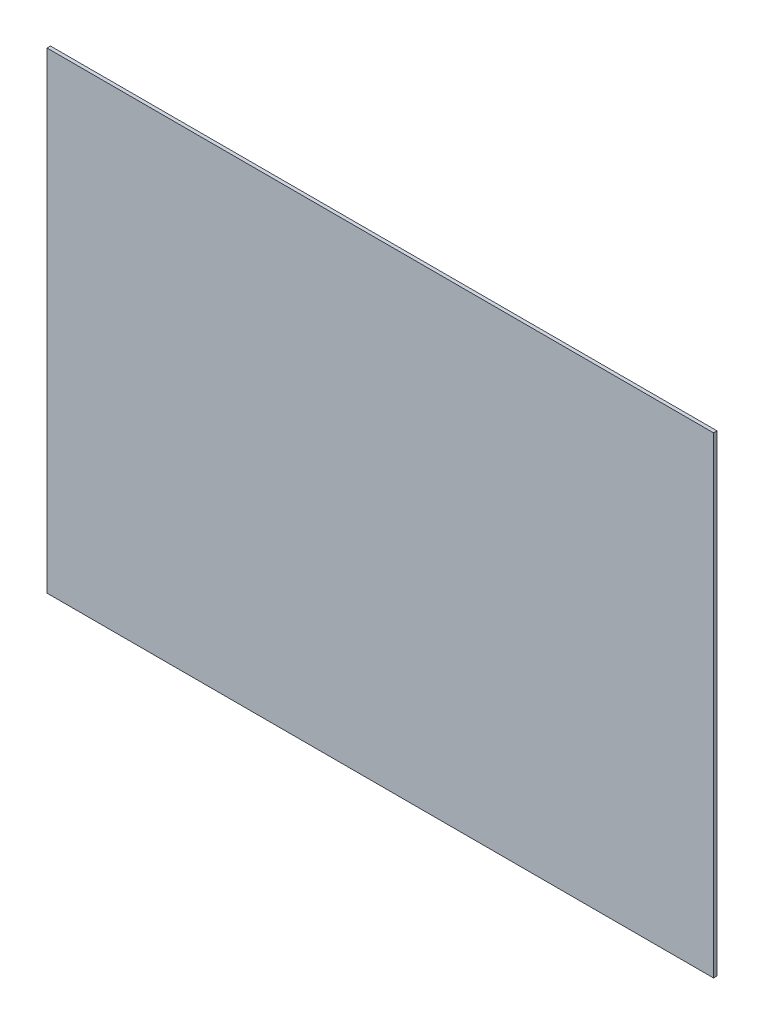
ISO-10303-21;
HEADER;
FILE_DESCRIPTION(('STEP AP214'),'2;1');
FILE_NAME('part.step','',(''),(''),'','','');
FILE_SCHEMA(('AUTOMOTIVE_DESIGN { 1 0 10303 214 1 1 1 1 }'));
ENDSEC;
DATA;
#1=APPLICATION_CONTEXT('core data for automotive mechanical design processes');
#2=APPLICATION_PROTOCOL_DEFINITION('international standard','automotive_design',2000,#1);
#3=PRODUCT_CONTEXT('',#1,'mechanical');
#4=PRODUCT('Part','Part','',(#3));
#5=PRODUCT_RELATED_PRODUCT_CATEGORY('part','',(#4));
#6=PRODUCT_DEFINITION_FORMATION('','',#4);
#7=PRODUCT_DEFINITION_CONTEXT('part definition',#1,'design');
#8=PRODUCT_DEFINITION('design','',#6,#7);
#9=PRODUCT_DEFINITION_SHAPE('','',#8);
#10=(LENGTH_UNIT() NAMED_UNIT(*) SI_UNIT(.MILLI.,.METRE.));
#11=(NAMED_UNIT(*) PLANE_ANGLE_UNIT() SI_UNIT($,.RADIAN.));
#12=(NAMED_UNIT(*) SI_UNIT($,.STERADIAN.) SOLID_ANGLE_UNIT());
#13=UNCERTAINTY_MEASURE_WITH_UNIT(LENGTH_MEASURE(1.E-05),#10,'distance_accuracy_value','');
#14=(GEOMETRIC_REPRESENTATION_CONTEXT(3) GLOBAL_UNCERTAINTY_ASSIGNED_CONTEXT((#13)) GLOBAL_UNIT_ASSIGNED_CONTEXT((#10,
#11,#12)) REPRESENTATION_CONTEXT('',''));
#15=CARTESIAN_POINT('',(0.,0.,0.));
#16=DIRECTION('',(0.,0.,1.));
#17=DIRECTION('',(1.,0.,0.));
#18=AXIS2_PLACEMENT_3D('',#15,#16,#17);
#19=CARTESIAN_POINT('',(-304.8,215.9,3.175));
#20=DIRECTION('',(1.,0.,0.));
#21=DIRECTION('',(0.,0.,-1.));
#22=AXIS2_PLACEMENT_3D('',#19,#20,#21);
#23=PLANE('',#22);
#24=DIRECTION('',(0.,-1.,0.));
#25=VECTOR('',#24,1.);
#26=CARTESIAN_POINT('',(-304.8,215.9,0.));
#27=LINE('',#26,#25);
#28=CARTESIAN_POINT('',(-304.8,215.9,0.));
#29=VERTEX_POINT('',#28);
#30=CARTESIAN_POINT('',(-304.8,-215.9,0.));
#31=VERTEX_POINT('',#30);
#32=EDGE_CURVE('E98',#29,#31,#27,.T.);
#33=ORIENTED_EDGE('',*,*,#32,.T.);
#34=DIRECTION('',(0.,0.,-1.));
#35=VECTOR('',#34,1.);
#36=CARTESIAN_POINT('',(-304.8,-215.9,3.175));
#37=LINE('',#36,#35);
#38=CARTESIAN_POINT('',(-304.8,-215.9,3.175));
#39=VERTEX_POINT('',#38);
#40=EDGE_CURVE('E11',#39,#31,#37,.T.);
#41=ORIENTED_EDGE('',*,*,#40,.F.);
#42=DIRECTION('',(0.,-1.,0.));
#43=VECTOR('',#42,1.);
#44=CARTESIAN_POINT('',(-304.8,215.9,3.175));
#45=LINE('',#44,#43);
#46=CARTESIAN_POINT('',(-304.8,215.9,3.175));
#47=VERTEX_POINT('',#46);
#48=EDGE_CURVE('E86',#47,#39,#45,.T.);
#49=ORIENTED_EDGE('',*,*,#48,.F.);
#50=DIRECTION('',(0.,0.,-1.));
#51=VECTOR('',#50,1.);
#52=CARTESIAN_POINT('',(-304.8,215.9,3.175));
#53=LINE('',#52,#51);
#54=EDGE_CURVE('E94',#47,#29,#53,.T.);
#55=ORIENTED_EDGE('',*,*,#54,.T.);
#56=EDGE_LOOP('',(#33,#41,#49,#55));
#57=FACE_BOUND('',#56,.T.);
#58=ADVANCED_FACE('F35',(#57),#23,.F.);
#59=CARTESIAN_POINT('',(-304.8,-215.9,3.175));
#60=DIRECTION('',(0.,1.,0.));
#61=DIRECTION('',(0.,0.,1.));
#62=AXIS2_PLACEMENT_3D('',#59,#60,#61);
#63=PLANE('',#62);
#64=DIRECTION('',(1.,0.,0.));
#65=VECTOR('',#64,1.);
#66=CARTESIAN_POINT('',(-304.8,-215.9,0.));
#67=LINE('',#66,#65);
#68=CARTESIAN_POINT('',(304.8,-215.9,0.));
#69=VERTEX_POINT('',#68);
#70=EDGE_CURVE('E90',#31,#69,#67,.T.);
#71=ORIENTED_EDGE('',*,*,#70,.T.);
#72=DIRECTION('',(0.,0.,-1.));
#73=VECTOR('',#72,1.);
#74=CARTESIAN_POINT('',(304.8,-215.9,3.175));
#75=LINE('',#74,#73);
#76=CARTESIAN_POINT('',(304.8,-215.9,3.175));
#77=VERTEX_POINT('',#76);
#78=EDGE_CURVE('E43',#77,#69,#75,.T.);
#79=ORIENTED_EDGE('',*,*,#78,.F.);
#80=DIRECTION('',(1.,0.,0.));
#81=VECTOR('',#80,1.);
#82=CARTESIAN_POINT('',(-304.8,-215.9,3.175));
#83=LINE('',#82,#81);
#84=EDGE_CURVE('E81',#39,#77,#83,.T.);
#85=ORIENTED_EDGE('',*,*,#84,.F.);
#86=ORIENTED_EDGE('',*,*,#40,.T.);
#87=EDGE_LOOP('',(#71,#79,#85,#86));
#88=FACE_BOUND('',#87,.T.);
#89=ADVANCED_FACE('F89',(#88),#63,.F.);
#90=CARTESIAN_POINT('',(304.8,215.9,3.175));
#91=DIRECTION('',(-1.,0.,0.));
#92=DIRECTION('',(0.,0.,1.));
#93=AXIS2_PLACEMENT_3D('',#90,#91,#92);
#94=PLANE('',#93);
#95=DIRECTION('',(0.,1.,0.));
#96=VECTOR('',#95,1.);
#97=CARTESIAN_POINT('',(304.8,215.9,0.));
#98=LINE('',#97,#96);
#99=CARTESIAN_POINT('',(304.8,215.9,0.));
#100=VERTEX_POINT('',#99);
#101=EDGE_CURVE('E68',#69,#100,#98,.T.);
#102=ORIENTED_EDGE('',*,*,#101,.T.);
#103=DIRECTION('',(0.,0.,-1.));
#104=VECTOR('',#103,1.);
#105=CARTESIAN_POINT('',(304.8,215.9,3.175));
#106=LINE('',#105,#104);
#107=CARTESIAN_POINT('',(304.8,215.9,3.175));
#108=VERTEX_POINT('',#107);
#109=EDGE_CURVE('E91',#108,#100,#106,.T.);
#110=ORIENTED_EDGE('',*,*,#109,.F.);
#111=DIRECTION('',(0.,1.,0.));
#112=VECTOR('',#111,1.);
#113=CARTESIAN_POINT('',(304.8,215.9,3.175));
#114=LINE('',#113,#112);
#115=EDGE_CURVE('E84',#77,#108,#114,.T.);
#116=ORIENTED_EDGE('',*,*,#115,.F.);
#117=ORIENTED_EDGE('',*,*,#78,.T.);
#118=EDGE_LOOP('',(#102,#110,#116,#117));
#119=FACE_BOUND('',#118,.T.);
#120=ADVANCED_FACE('F92',(#119),#94,.F.);
#121=CARTESIAN_POINT('',(-304.8,215.9,3.175));
#122=DIRECTION('',(0.,-1.,0.));
#123=DIRECTION('',(0.,0.,-1.));
#124=AXIS2_PLACEMENT_3D('',#121,#122,#123);
#125=PLANE('',#124);
#126=DIRECTION('',(-1.,0.,0.));
#127=VECTOR('',#126,1.);
#128=CARTESIAN_POINT('',(-304.8,215.9,0.));
#129=LINE('',#128,#127);
#130=EDGE_CURVE('E74',#100,#29,#129,.T.);
#131=ORIENTED_EDGE('',*,*,#130,.T.);
#132=ORIENTED_EDGE('',*,*,#54,.F.);
#133=DIRECTION('',(-1.,0.,0.));
#134=VECTOR('',#133,1.);
#135=CARTESIAN_POINT('',(-304.8,215.9,3.175));
#136=LINE('',#135,#134);
#137=EDGE_CURVE('E51',#108,#47,#136,.T.);
#138=ORIENTED_EDGE('',*,*,#137,.F.);
#139=ORIENTED_EDGE('',*,*,#109,.T.);
#140=EDGE_LOOP('',(#131,#132,#138,#139));
#141=FACE_BOUND('',#140,.T.);
#142=ADVANCED_FACE('F105',(#141),#125,.F.);
#143=CARTESIAN_POINT('',(0.,0.,3.175));
#144=DIRECTION('',(0.,0.,1.));
#145=DIRECTION('',(1.,0.,0.));
#146=AXIS2_PLACEMENT_3D('',#143,#144,#145);
#147=PLANE('',#146);
#148=ORIENTED_EDGE('',*,*,#48,.T.);
#149=ORIENTED_EDGE('',*,*,#84,.T.);
#150=ORIENTED_EDGE('',*,*,#115,.T.);
#151=ORIENTED_EDGE('',*,*,#137,.T.);
#152=EDGE_LOOP('',(#148,#149,#150,#151));
#153=FACE_BOUND('',#152,.T.);
#154=ADVANCED_FACE('F82',(#153),#147,.T.);
#155=CARTESIAN_POINT('',(0.,0.,0.));
#156=DIRECTION('',(0.,0.,1.));
#157=DIRECTION('',(1.,0.,0.));
#158=AXIS2_PLACEMENT_3D('',#155,#156,#157);
#159=PLANE('',#158);
#160=ORIENTED_EDGE('',*,*,#32,.F.);
#161=ORIENTED_EDGE('',*,*,#130,.F.);
#162=ORIENTED_EDGE('',*,*,#101,.F.);
#163=ORIENTED_EDGE('',*,*,#70,.F.);
#164=EDGE_LOOP('',(#160,#161,#162,#163));
#165=FACE_BOUND('',#164,.T.);
#166=ADVANCED_FACE('F108',(#165),#159,.F.);
#167=CLOSED_SHELL('',(#58,#89,#120,#142,#154,#166));
#168=MANIFOLD_SOLID_BREP('B2',#167);
#169=ADVANCED_BREP_SHAPE_REPRESENTATION('',(#18,#168),#14);
#170=SHAPE_DEFINITION_REPRESENTATION(#9,#169);
ENDSEC;
END-ISO-10303-21;
